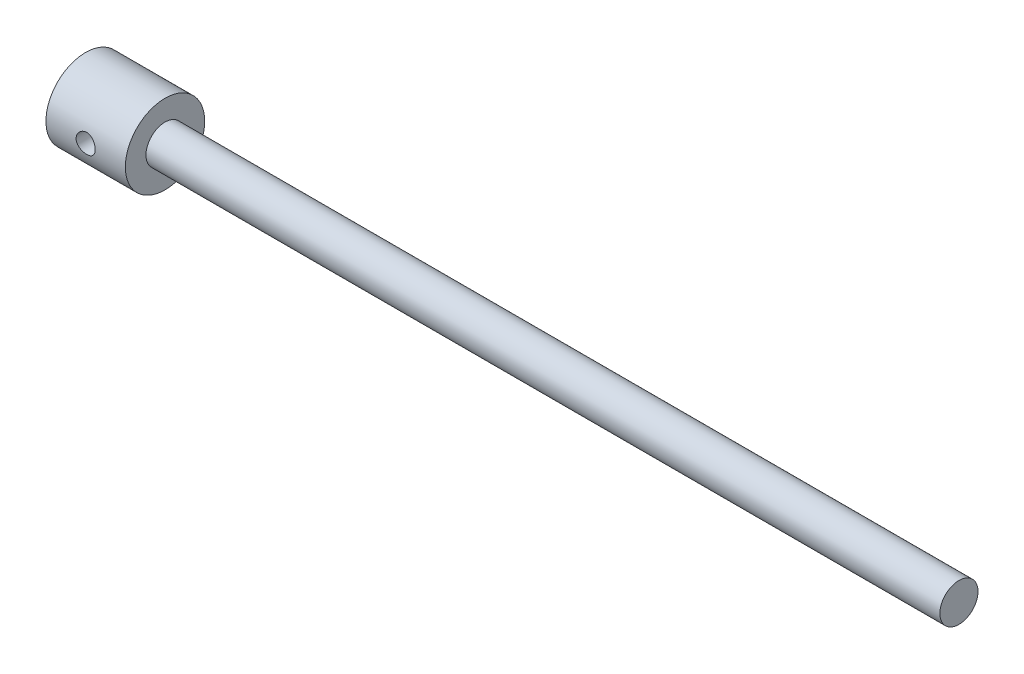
from build123d import *

# Parameters (mm, degrees)
SKETCH1_R               = 25
BOSS_EXTRUDE1_DEPTH     = 50
CUT_EXTRUDE1_DEPTH      = 62.23724357
CUT_EXTRUDE1_DEPTH_BACK = 62.23724357
SKETCH2_R               = 6
SKETCH3_R               = 12
BOSS_EXTRUDE2_DEPTH     = 500


with BuildPart() as part:
    # Sketch1 → Boss-Extrude1 (new body)
    with BuildSketch(Plane(origin=(0, 0, 0), x_dir=(0, 0, -1), z_dir=(1, 0, 0))):
        Circle(SKETCH1_R)
    extrude(amount=BOSS_EXTRUDE1_DEPTH)

    # Sketch2 → Cut-Extrude1 (cut, two sides: drawn at the far end of the back side and taken through both)
    with BuildSketch(Plane.XY.offset(-CUT_EXTRUDE1_DEPTH_BACK)):
        with Locations((25, 0)):
            Circle(SKETCH2_R)
    extrude(amount=CUT_EXTRUDE1_DEPTH + CUT_EXTRUDE1_DEPTH_BACK, mode=Mode.SUBTRACT)

    # Sketch3 → Boss-Extrude2 (add)
    with BuildSketch(Plane(origin=(50, 0, 0), x_dir=(0, 0, -1), z_dir=(1, 0, 0))):
        Circle(SKETCH3_R)
    extrude(amount=BOSS_EXTRUDE2_DEPTH)


solid = part.part
